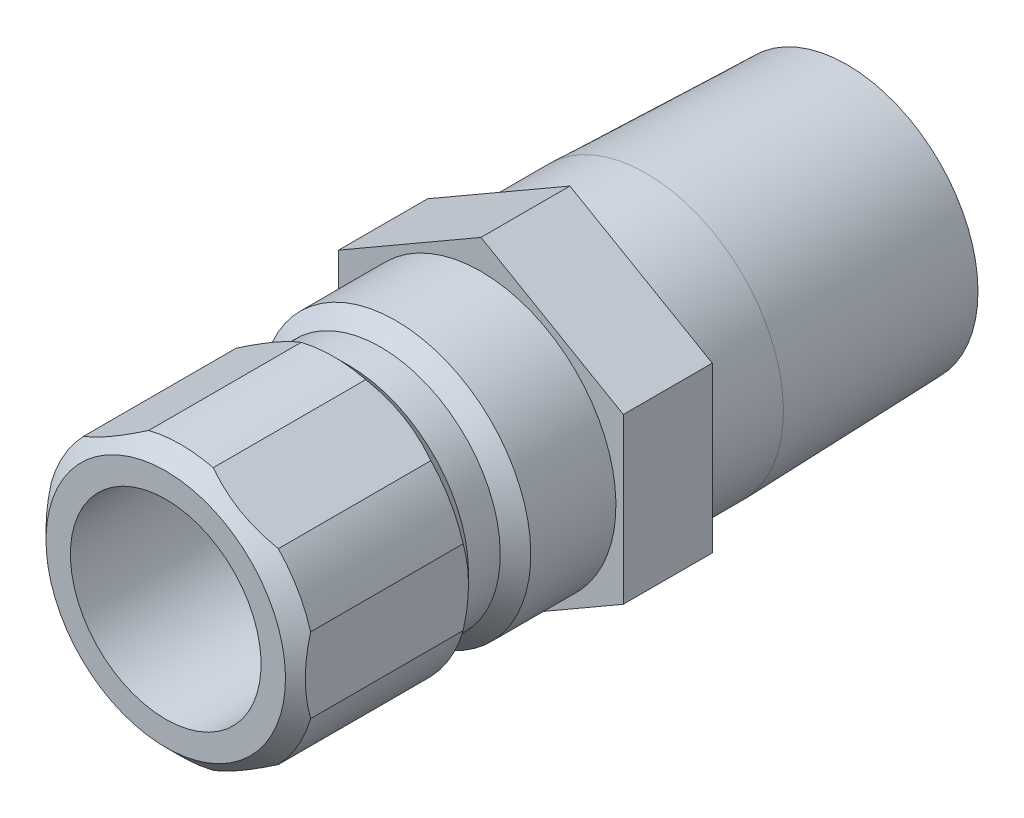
ISO-10303-21;
HEADER;
FILE_DESCRIPTION(('STEP AP214'),'2;1');
FILE_NAME('part.step','',(''),(''),'','','');
FILE_SCHEMA(('AUTOMOTIVE_DESIGN { 1 0 10303 214 1 1 1 1 }'));
ENDSEC;
DATA;
#1=APPLICATION_CONTEXT('core data for automotive mechanical design processes');
#2=APPLICATION_PROTOCOL_DEFINITION('international standard','automotive_design',2000,#1);
#3=PRODUCT_CONTEXT('',#1,'mechanical');
#4=PRODUCT('Part','Part','',(#3));
#5=PRODUCT_RELATED_PRODUCT_CATEGORY('part','',(#4));
#6=PRODUCT_DEFINITION_FORMATION('','',#4);
#7=PRODUCT_DEFINITION_CONTEXT('part definition',#1,'design');
#8=PRODUCT_DEFINITION('design','',#6,#7);
#9=PRODUCT_DEFINITION_SHAPE('','',#8);
#10=(LENGTH_UNIT() NAMED_UNIT(*) SI_UNIT(.MILLI.,.METRE.));
#11=(NAMED_UNIT(*) PLANE_ANGLE_UNIT() SI_UNIT($,.RADIAN.));
#12=(NAMED_UNIT(*) SI_UNIT($,.STERADIAN.) SOLID_ANGLE_UNIT());
#13=UNCERTAINTY_MEASURE_WITH_UNIT(LENGTH_MEASURE(1.E-05),#10,'distance_accuracy_value','');
#14=(GEOMETRIC_REPRESENTATION_CONTEXT(3) GLOBAL_UNCERTAINTY_ASSIGNED_CONTEXT((#13)) GLOBAL_UNIT_ASSIGNED_CONTEXT((#10,
#11,#12)) REPRESENTATION_CONTEXT('',''));
#15=CARTESIAN_POINT('',(0.,0.,0.));
#16=DIRECTION('',(0.,0.,1.));
#17=DIRECTION('',(1.,0.,0.));
#18=AXIS2_PLACEMENT_3D('',#15,#16,#17);
#19=CARTESIAN_POINT('',(0.,0.,0.));
#20=DIRECTION('',(0.,0.,-1.));
#21=DIRECTION('',(0.,1.,0.));
#22=AXIS2_PLACEMENT_3D('',#19,#20,#21);
#23=CYLINDRICAL_SURFACE('',#22,6.7437);
#24=DIRECTION('',(0.,0.,-1.));
#25=VECTOR('',#24,1.);
#26=CARTESIAN_POINT('',(-4.8646828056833,4.67036945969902,0.));
#27=LINE('',#26,#25);
#28=CARTESIAN_POINT('',(-4.86468280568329,4.67036945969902,7.36599999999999));
#29=VERTEX_POINT('',#28);
#30=CARTESIAN_POINT('',(-4.8646828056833,4.67036945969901,14.986));
#31=VERTEX_POINT('',#30);
#32=EDGE_CURVE('E526',#29,#31,#27,.F.);
#33=ORIENTED_EDGE('',*,*,#32,.F.);
#34=CARTESIAN_POINT('',(0.,0.,7.36599999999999));
#35=DIRECTION('',(0.,0.,-1.));
#36=DIRECTION('',(0.,1.,0.));
#37=AXIS2_PLACEMENT_3D('',#34,#35,#36);
#38=CIRCLE('',#37,6.7437);
#39=CARTESIAN_POINT('',(-6.477,1.87775416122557,7.36599999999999));
#40=VERTEX_POINT('',#39);
#41=EDGE_CURVE('E188',#40,#29,#38,.T.);
#42=ORIENTED_EDGE('',*,*,#41,.F.);
#43=DIRECTION('',(0.,0.,-1.));
#44=VECTOR('',#43,1.);
#45=CARTESIAN_POINT('',(-6.477,1.87775416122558,0.));
#46=LINE('',#45,#44);
#47=CARTESIAN_POINT('',(-6.477,1.87775416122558,14.986));
#48=VERTEX_POINT('',#47);
#49=EDGE_CURVE('E61',#48,#40,#46,.T.);
#50=ORIENTED_EDGE('',*,*,#49,.F.);
#51=CARTESIAN_POINT('',(0.,0.,14.986));
#52=DIRECTION('',(0.,0.,-1.));
#53=DIRECTION('',(0.,1.,0.));
#54=AXIS2_PLACEMENT_3D('',#51,#52,#53);
#55=CIRCLE('',#54,6.7437);
#56=EDGE_CURVE('E199',#48,#31,#55,.T.);
#57=ORIENTED_EDGE('',*,*,#56,.T.);
#58=EDGE_LOOP('',(#33,#42,#50,#57));
#59=FACE_BOUND('',#58,.T.);
#60=ADVANCED_FACE('F34',(#59),#23,.T.);
#61=DIRECTION('',(0.,0.,-1.));
#62=VECTOR('',#61,1.);
#63=CARTESIAN_POINT('',(-6.477,-1.87775416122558,0.));
#64=LINE('',#63,#62);
#65=CARTESIAN_POINT('',(-6.477,-1.87775416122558,7.36599999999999));
#66=VERTEX_POINT('',#65);
#67=CARTESIAN_POINT('',(-6.477,-1.87775416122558,14.986));
#68=VERTEX_POINT('',#67);
#69=EDGE_CURVE('E219',#66,#68,#64,.F.);
#70=ORIENTED_EDGE('',*,*,#69,.F.);
#71=CARTESIAN_POINT('',(-4.86468280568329,-4.67036945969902,7.36599999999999));
#72=VERTEX_POINT('',#71);
#73=EDGE_CURVE('E192',#72,#66,#38,.T.);
#74=ORIENTED_EDGE('',*,*,#73,.F.);
#75=DIRECTION('',(0.,0.,-1.));
#76=VECTOR('',#75,1.);
#77=CARTESIAN_POINT('',(-4.86468280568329,-4.67036945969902,0.));
#78=LINE('',#77,#76);
#79=CARTESIAN_POINT('',(-4.86468280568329,-4.67036945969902,14.986));
#80=VERTEX_POINT('',#79);
#81=EDGE_CURVE('E217',#80,#72,#78,.T.);
#82=ORIENTED_EDGE('',*,*,#81,.F.);
#83=EDGE_CURVE('E220',#80,#68,#55,.T.);
#84=ORIENTED_EDGE('',*,*,#83,.T.);
#85=EDGE_LOOP('',(#70,#74,#82,#84));
#86=FACE_BOUND('',#85,.T.);
#87=ADVANCED_FACE('F215',(#86),#23,.T.);
#88=DIRECTION('',(0.,0.,-1.));
#89=VECTOR('',#88,1.);
#90=CARTESIAN_POINT('',(-1.61231719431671,-6.5481236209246,0.));
#91=LINE('',#90,#89);
#92=CARTESIAN_POINT('',(-1.61231719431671,-6.5481236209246,7.36599999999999));
#93=VERTEX_POINT('',#92);
#94=CARTESIAN_POINT('',(-1.61231719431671,-6.5481236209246,14.986));
#95=VERTEX_POINT('',#94);
#96=EDGE_CURVE('E298',#93,#95,#91,.F.);
#97=ORIENTED_EDGE('',*,*,#96,.F.);
#98=CARTESIAN_POINT('',(1.61231719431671,-6.5481236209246,7.36599999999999));
#99=VERTEX_POINT('',#98);
#100=EDGE_CURVE('E202',#99,#93,#38,.T.);
#101=ORIENTED_EDGE('',*,*,#100,.F.);
#102=DIRECTION('',(0.,0.,-1.));
#103=VECTOR('',#102,1.);
#104=CARTESIAN_POINT('',(1.6123171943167,-6.5481236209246,0.));
#105=LINE('',#104,#103);
#106=CARTESIAN_POINT('',(1.6123171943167,-6.5481236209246,14.986));
#107=VERTEX_POINT('',#106);
#108=EDGE_CURVE('E315',#107,#99,#105,.T.);
#109=ORIENTED_EDGE('',*,*,#108,.F.);
#110=EDGE_CURVE('E311',#107,#95,#55,.T.);
#111=ORIENTED_EDGE('',*,*,#110,.T.);
#112=EDGE_LOOP('',(#97,#101,#109,#111));
#113=FACE_BOUND('',#112,.T.);
#114=ADVANCED_FACE('F314',(#113),#23,.T.);
#115=DIRECTION('',(0.,0.,-1.));
#116=VECTOR('',#115,1.);
#117=CARTESIAN_POINT('',(4.8646828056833,-4.67036945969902,0.));
#118=LINE('',#117,#116);
#119=CARTESIAN_POINT('',(4.8646828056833,-4.67036945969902,7.36599999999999));
#120=VERTEX_POINT('',#119);
#121=CARTESIAN_POINT('',(4.8646828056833,-4.67036945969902,14.986));
#122=VERTEX_POINT('',#121);
#123=EDGE_CURVE('E295',#120,#122,#118,.F.);
#124=ORIENTED_EDGE('',*,*,#123,.F.);
#125=CARTESIAN_POINT('',(6.477,-1.87775416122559,7.36599999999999));
#126=VERTEX_POINT('',#125);
#127=EDGE_CURVE('E197',#126,#120,#38,.T.);
#128=ORIENTED_EDGE('',*,*,#127,.F.);
#129=DIRECTION('',(0.,0.,-1.));
#130=VECTOR('',#129,1.);
#131=CARTESIAN_POINT('',(6.477,-1.87775416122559,0.));
#132=LINE('',#131,#130);
#133=CARTESIAN_POINT('',(6.477,-1.87775416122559,14.986));
#134=VERTEX_POINT('',#133);
#135=EDGE_CURVE('E362',#134,#126,#132,.T.);
#136=ORIENTED_EDGE('',*,*,#135,.F.);
#137=EDGE_CURVE('E316',#134,#122,#55,.T.);
#138=ORIENTED_EDGE('',*,*,#137,.T.);
#139=EDGE_LOOP('',(#124,#128,#136,#138));
#140=FACE_BOUND('',#139,.T.);
#141=ADVANCED_FACE('F349',(#140),#23,.T.);
#142=DIRECTION('',(0.,0.,-1.));
#143=VECTOR('',#142,1.);
#144=CARTESIAN_POINT('',(6.477,1.87775416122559,0.));
#145=LINE('',#144,#143);
#146=CARTESIAN_POINT('',(6.477,1.87775416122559,7.36599999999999));
#147=VERTEX_POINT('',#146);
#148=CARTESIAN_POINT('',(6.477,1.87775416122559,14.986));
#149=VERTEX_POINT('',#148);
#150=EDGE_CURVE('E357',#147,#149,#145,.F.);
#151=ORIENTED_EDGE('',*,*,#150,.F.);
#152=CARTESIAN_POINT('',(4.86468280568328,4.67036945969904,7.36599999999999));
#153=VERTEX_POINT('',#152);
#154=EDGE_CURVE('E191',#153,#147,#38,.T.);
#155=ORIENTED_EDGE('',*,*,#154,.F.);
#156=DIRECTION('',(0.,0.,-1.));
#157=VECTOR('',#156,1.);
#158=CARTESIAN_POINT('',(4.86468280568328,4.67036945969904,0.));
#159=LINE('',#158,#157);
#160=CARTESIAN_POINT('',(4.86468280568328,4.67036945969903,14.986));
#161=VERTEX_POINT('',#160);
#162=EDGE_CURVE('E168',#161,#153,#159,.T.);
#163=ORIENTED_EDGE('',*,*,#162,.F.);
#164=EDGE_CURVE('E200',#161,#149,#55,.T.);
#165=ORIENTED_EDGE('',*,*,#164,.T.);
#166=EDGE_LOOP('',(#151,#155,#163,#165));
#167=FACE_BOUND('',#166,.T.);
#168=ADVANCED_FACE('F334',(#167),#23,.T.);
#169=CARTESIAN_POINT('',(0.,0.,0.));
#170=DIRECTION('',(0.,0.,-1.));
#171=DIRECTION('',(0.,1.,0.));
#172=AXIS2_PLACEMENT_3D('',#169,#170,#171);
#173=CYLINDRICAL_SURFACE('',#172,6.858);
#174=CARTESIAN_POINT('',(0.,0.,-8.25500000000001));
#175=DIRECTION('',(0.,0.,-1.));
#176=DIRECTION('',(0.,1.,0.));
#177=AXIS2_PLACEMENT_3D('',#174,#175,#176);
#178=CIRCLE('',#177,6.858);
#179=CARTESIAN_POINT('',(0.,6.858,-8.25500000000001));
#180=VERTEX_POINT('',#179);
#181=EDGE_CURVE('E455',#180,#180,#178,.T.);
#182=ORIENTED_EDGE('',*,*,#181,.F.);
#183=EDGE_LOOP('',(#182));
#184=FACE_BOUND('',#183,.T.);
#185=CARTESIAN_POINT('',(0.,0.,-4.445));
#186=DIRECTION('',(0.,0.,1.));
#187=DIRECTION('',(1.,0.,0.));
#188=AXIS2_PLACEMENT_3D('',#185,#186,#187);
#189=CIRCLE('',#188,6.858);
#190=CARTESIAN_POINT('',(6.858,0.,-4.445));
#191=VERTEX_POINT('',#190);
#192=EDGE_CURVE('E471',#191,#191,#189,.F.);
#193=ORIENTED_EDGE('',*,*,#192,.T.);
#194=EDGE_LOOP('',(#193));
#195=FACE_BOUND('',#194,.T.);
#196=ADVANCED_FACE('F328',(#184,#195),#173,.T.);
#197=CARTESIAN_POINT('',(0.,0.,0.));
#198=DIRECTION('',(0.,0.,-1.));
#199=DIRECTION('',(0.,1.,0.));
#200=AXIS2_PLACEMENT_3D('',#197,#198,#199);
#201=CYLINDRICAL_SURFACE('',#200,4.7625);
#202=CARTESIAN_POINT('',(0.,0.,3.556));
#203=DIRECTION('',(0.,0.,-1.));
#204=DIRECTION('',(0.,1.,0.));
#205=AXIS2_PLACEMENT_3D('',#202,#203,#204);
#206=CIRCLE('',#205,4.7625);
#207=CARTESIAN_POINT('',(0.,4.7625,3.556));
#208=VERTEX_POINT('',#207);
#209=EDGE_CURVE('E469',#208,#208,#206,.T.);
#210=ORIENTED_EDGE('',*,*,#209,.T.);
#211=EDGE_LOOP('',(#210));
#212=FACE_BOUND('',#211,.T.);
#213=CARTESIAN_POINT('',(0.,0.,15.748));
#214=DIRECTION('',(0.,0.,-1.));
#215=DIRECTION('',(0.,1.,0.));
#216=AXIS2_PLACEMENT_3D('',#213,#214,#215);
#217=CIRCLE('',#216,4.7625);
#218=CARTESIAN_POINT('',(0.,4.7625,15.748));
#219=VERTEX_POINT('',#218);
#220=EDGE_CURVE('E174',#219,#219,#217,.T.);
#221=ORIENTED_EDGE('',*,*,#220,.F.);
#222=EDGE_LOOP('',(#221));
#223=FACE_BOUND('',#222,.T.);
#224=ADVANCED_FACE('F36',(#212,#223),#201,.F.);
#225=CARTESIAN_POINT('',(0.,4.7625,15.748));
#226=DIRECTION('',(0.,0.,1.));
#227=DIRECTION('',(0.,-1.,0.));
#228=AXIS2_PLACEMENT_3D('',#225,#226,#227);
#229=PLANE('',#228);
#230=ORIENTED_EDGE('',*,*,#220,.T.);
#231=EDGE_LOOP('',(#230));
#232=FACE_BOUND('',#231,.T.);
#233=CARTESIAN_POINT('',(0.,0.,15.748));
#234=DIRECTION('',(0.,0.,-1.));
#235=DIRECTION('',(0.,1.,0.));
#236=AXIS2_PLACEMENT_3D('',#233,#234,#235);
#237=CIRCLE('',#236,5.9817);
#238=CARTESIAN_POINT('',(0.,5.9817,15.748));
#239=VERTEX_POINT('',#238);
#240=EDGE_CURVE('E319',#239,#239,#237,.T.);
#241=ORIENTED_EDGE('',*,*,#240,.F.);
#242=EDGE_LOOP('',(#241));
#243=FACE_BOUND('',#242,.T.);
#244=ADVANCED_FACE('F324',(#232,#243),#229,.T.);
#245=CARTESIAN_POINT('',(0.,0.,14.986));
#246=DIRECTION('',(0.,0.,-1.));
#247=DIRECTION('',(0.,1.,0.));
#248=AXIS2_PLACEMENT_3D('',#245,#246,#247);
#249=CONICAL_SURFACE('',#248,6.7437,0.785398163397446);
#250=CARTESIAN_POINT('',(-4.86530473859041,4.67001038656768,14.9858));
#251=CARTESIAN_POINT('',(-4.72486305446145,4.75109443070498,15.0310202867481));
#252=CARTESIAN_POINT('',(-4.58312979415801,4.83292416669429,15.0711660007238));
#253=CARTESIAN_POINT('',(-4.29751110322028,4.99782619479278,15.1402365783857));
#254=CARTESIAN_POINT('',(-4.1536239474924,5.0808994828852,15.1691518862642));
#255=CARTESIAN_POINT('',(-3.8673393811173,5.2461859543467,15.2141425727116));
#256=CARTESIAN_POINT('',(-3.7249720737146,5.32838175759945,15.2304694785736));
#257=CARTESIAN_POINT('',(-3.43963286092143,5.49312242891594,15.2506210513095));
#258=CARTESIAN_POINT('',(-3.29666126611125,5.57566711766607,15.2544515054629));
#259=CARTESIAN_POINT('',(-3.02472390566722,5.73267022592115,15.2497120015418));
#260=CARTESIAN_POINT('',(-2.89574173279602,5.807138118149,15.2423062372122));
#261=CARTESIAN_POINT('',(-2.63846984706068,5.95567411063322,15.2174303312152));
#262=CARTESIAN_POINT('',(-2.51018036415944,6.02974207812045,15.1999570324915));
#263=CARTESIAN_POINT('',(-2.25244237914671,6.17854717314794,15.1550584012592));
#264=CARTESIAN_POINT('',(-2.1230180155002,6.25327036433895,15.1274506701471));
#265=CARTESIAN_POINT('',(-1.86594955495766,6.40168890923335,15.0631944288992));
#266=CARTESIAN_POINT('',(-1.73830430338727,6.47538492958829,15.026552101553));
#267=CARTESIAN_POINT('',(-1.61169526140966,6.5484826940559,14.9858));
#268=B_SPLINE_CURVE_WITH_KNOTS('',3,(#250,#251,#252,#253,#254,#255,#256,#257,#258,#259,#260,
#261,#262,#263,#264,#265,#266,#267),.UNSPECIFIED.,.F.,.F.,(4,2,2,2,2,2,2,2,4),(0.,
0.505093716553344,1.01061627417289,1.50575564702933,2.00066568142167,2.4476800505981,
2.89483467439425,3.35046683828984,3.80578805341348),.UNSPECIFIED.);
#269=CARTESIAN_POINT('',(-1.6123171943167,6.5481236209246,14.986));
#270=VERTEX_POINT('',#269);
#271=EDGE_CURVE('E506',#31,#270,#268,.T.);
#272=ORIENTED_EDGE('',*,*,#271,.F.);
#273=ORIENTED_EDGE('',*,*,#56,.F.);
#274=CARTESIAN_POINT('',(-6.477,-7.31595245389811,11.9585849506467));
#275=CARTESIAN_POINT('',(-6.477,-7.1371619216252,12.09242068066));
#276=CARTESIAN_POINT('',(-6.477,-6.95735466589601,12.2249205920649));
#277=CARTESIAN_POINT('',(-6.477,-6.59531185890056,12.4866559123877));
#278=CARTESIAN_POINT('',(-6.477,-6.41307569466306,12.6158904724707));
#279=CARTESIAN_POINT('',(-6.477,-6.04444818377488,12.8714195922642));
#280=CARTESIAN_POINT('',(-6.477,-5.85803557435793,12.9976835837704));
#281=CARTESIAN_POINT('',(-6.477,-5.48202253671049,13.245356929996));
#282=CARTESIAN_POINT('',(-6.477,-5.29242233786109,13.3667666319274));
#283=CARTESIAN_POINT('',(-6.477,-4.8990824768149,13.6101330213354));
#284=CARTESIAN_POINT('',(-6.477,-4.69513615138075,13.7317573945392));
#285=CARTESIAN_POINT('',(-6.477,-4.2824994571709,13.9668032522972));
#286=CARTESIAN_POINT('',(-6.477,-4.07380836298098,14.0802234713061));
#287=CARTESIAN_POINT('',(-6.477,-3.65173370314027,14.2964010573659));
#288=CARTESIAN_POINT('',(-6.477,-3.43836632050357,14.3991897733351));
#289=CARTESIAN_POINT('',(-6.477,-3.00590599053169,14.59180459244));
#290=CARTESIAN_POINT('',(-6.477,-2.78681563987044,14.6816364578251));
#291=CARTESIAN_POINT('',(-6.477,-2.35869152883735,14.8392509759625));
#292=CARTESIAN_POINT('',(-6.477,-2.15007621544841,14.9081583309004));
#293=CARTESIAN_POINT('',(-6.477,-1.72794730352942,15.029215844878));
#294=CARTESIAN_POINT('',(-6.477,-1.51443335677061,15.0813648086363));
#295=CARTESIAN_POINT('',(-6.477,-1.08726616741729,15.1653541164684));
#296=CARTESIAN_POINT('',(-6.477,-0.873680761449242,15.1975339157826));
#297=CARTESIAN_POINT('',(-6.477,-0.444382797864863,15.2409825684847));
#298=CARTESIAN_POINT('',(-6.477,-0.228670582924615,15.2522547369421));
#299=CARTESIAN_POINT('',(-6.477,0.195590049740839,15.2531049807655));
#300=CARTESIAN_POINT('',(-6.477,0.40413733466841,15.2433943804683));
#301=CARTESIAN_POINT('',(-6.477,0.819375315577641,15.2043531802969));
#302=CARTESIAN_POINT('',(-6.477,1.026065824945,15.1750206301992));
#303=CARTESIAN_POINT('',(-6.477,1.43958683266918,15.0978125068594));
#304=CARTESIAN_POINT('',(-6.477,1.64635839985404,15.0496261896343));
#305=CARTESIAN_POINT('',(-6.477,2.05541277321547,14.9372378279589));
#306=CARTESIAN_POINT('',(-6.477,2.25769600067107,14.8730372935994));
#307=CARTESIAN_POINT('',(-6.477,2.67942290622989,14.7234325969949));
#308=CARTESIAN_POINT('',(-6.477,2.89830973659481,14.6364736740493));
#309=CARTESIAN_POINT('',(-6.477,3.33036785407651,14.4492510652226));
#310=CARTESIAN_POINT('',(-6.477,3.5435363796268,14.3489810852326));
#311=CARTESIAN_POINT('',(-6.477,3.96521765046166,14.1375266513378));
#312=CARTESIAN_POINT('',(-6.477,4.17371291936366,14.026307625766));
#313=CARTESIAN_POINT('',(-6.477,4.58589470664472,13.7954185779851));
#314=CARTESIAN_POINT('',(-6.477,4.78958199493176,13.6757499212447));
#315=CARTESIAN_POINT('',(-6.477,5.18271200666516,13.4357848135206));
#316=CARTESIAN_POINT('',(-6.477,5.37235766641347,13.3158190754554));
#317=CARTESIAN_POINT('',(-6.477,5.74839484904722,13.0708760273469));
#318=CARTESIAN_POINT('',(-6.477,5.93478612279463,12.9458983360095));
#319=CARTESIAN_POINT('',(-6.477,6.30322303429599,12.6928680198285));
#320=CARTESIAN_POINT('',(-6.477,6.48529173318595,12.5648488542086));
#321=CARTESIAN_POINT('',(-6.477,6.84694630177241,12.3054498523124));
#322=CARTESIAN_POINT('',(-6.477,7.02653283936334,12.174070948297));
#323=CARTESIAN_POINT('',(-6.477,7.20508094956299,12.041319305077));
#324=B_SPLINE_CURVE_WITH_KNOTS('',3,(#274,#275,#276,#277,#278,#279,#280,#281,#282,#283,#284,
#285,#286,#287,#288,#289,#290,#291,#292,#293,#294,#295,#296,#297,#298,#299,#300,#301,#302,#303,
#304,#305,#306,#307,#308,#309,#310,#311,#312,#313,#314,#315,#316,#317,#318,#319,#320,#321,#322,
#323),.UNSPECIFIED.,.F.,.F.,(4,2,2,2,2,2,2,2,2,2,2,2,2,2,2,2,2,2,2,2,2,2,2,2,4),(0.,
0.670015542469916,1.34020350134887,2.01558827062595,2.69092464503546,3.40314702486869,
4.11547903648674,4.82564684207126,5.53549783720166,6.19401709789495,6.85258331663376,
7.49962373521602,8.14656155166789,8.77191276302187,9.39732613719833,10.0335138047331,
10.6696415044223,11.3756703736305,12.0820342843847,12.7907048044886,13.4992610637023,
14.1723809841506,14.845552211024,15.5132243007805,16.1807130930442),.UNSPECIFIED.);
#325=EDGE_CURVE('E222',#68,#48,#324,.T.);
#326=ORIENTED_EDGE('',*,*,#325,.F.);
#327=ORIENTED_EDGE('',*,*,#83,.F.);
#328=CARTESIAN_POINT('',(-1.61169526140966,-6.5484826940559,14.9858));
#329=CARTESIAN_POINT('',(-1.75213694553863,-6.4673986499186,15.0310202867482));
#330=CARTESIAN_POINT('',(-1.89387020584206,-6.38556891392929,15.0711660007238));
#331=CARTESIAN_POINT('',(-2.1794888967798,-6.2206668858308,15.1402365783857));
#332=CARTESIAN_POINT('',(-2.32337605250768,-6.13759359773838,15.1691518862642));
#333=CARTESIAN_POINT('',(-2.60966061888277,-5.97230712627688,15.2141425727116));
#334=CARTESIAN_POINT('',(-2.75202792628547,-5.89011132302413,15.2304694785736));
#335=CARTESIAN_POINT('',(-3.03736713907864,-5.72537065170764,15.2506210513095));
#336=CARTESIAN_POINT('',(-3.18033873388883,-5.64282596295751,15.2544515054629));
#337=CARTESIAN_POINT('',(-3.45227609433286,-5.48582285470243,15.2497120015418));
#338=CARTESIAN_POINT('',(-3.58125826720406,-5.41135496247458,15.2423062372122));
#339=CARTESIAN_POINT('',(-3.83853015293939,-5.26281896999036,15.2174303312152));
#340=CARTESIAN_POINT('',(-3.96681963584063,-5.18875100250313,15.1999570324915));
#341=CARTESIAN_POINT('',(-4.22455762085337,-5.03994590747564,15.1550584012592));
#342=CARTESIAN_POINT('',(-4.35398198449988,-4.96522271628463,15.1274506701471));
#343=CARTESIAN_POINT('',(-4.61105044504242,-4.81680417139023,15.0631944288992));
#344=CARTESIAN_POINT('',(-4.7386956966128,-4.74310815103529,15.026552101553));
#345=CARTESIAN_POINT('',(-4.86530473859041,-4.67001038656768,14.9858));
#346=B_SPLINE_CURVE_WITH_KNOTS('',3,(#328,#329,#330,#331,#332,#333,#334,#335,#336,#337,#338,
#339,#340,#341,#342,#343,#344,#345),.UNSPECIFIED.,.F.,.F.,(4,2,2,2,2,2,2,2,4),(0.,
0.505093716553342,1.01061627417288,1.50575564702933,2.00066568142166,2.44768005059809,
2.89483467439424,3.35046683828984,3.80578805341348),.UNSPECIFIED.);
#347=EDGE_CURVE('E225',#95,#80,#346,.T.);
#348=ORIENTED_EDGE('',*,*,#347,.F.);
#349=ORIENTED_EDGE('',*,*,#110,.F.);
#350=CARTESIAN_POINT('',(4.86530473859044,-4.67001038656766,14.9858));
#351=CARTESIAN_POINT('',(4.72486305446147,-4.75109443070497,15.0310202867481));
#352=CARTESIAN_POINT('',(4.58312979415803,-4.83292416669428,15.0711660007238));
#353=CARTESIAN_POINT('',(4.2975111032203,-4.99782619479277,15.1402365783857));
#354=CARTESIAN_POINT('',(4.15362394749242,-5.08089948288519,15.1691518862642));
#355=CARTESIAN_POINT('',(3.86733938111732,-5.24618595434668,15.2141425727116));
#356=CARTESIAN_POINT('',(3.72497207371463,-5.32838175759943,15.2304694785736));
#357=CARTESIAN_POINT('',(3.43963286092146,-5.49312242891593,15.2506210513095));
#358=CARTESIAN_POINT('',(3.29666126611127,-5.57566711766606,15.2544515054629));
#359=CARTESIAN_POINT('',(3.0247239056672,-5.73267022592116,15.2497120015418));
#360=CARTESIAN_POINT('',(2.89574173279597,-5.80713811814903,15.2423062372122));
#361=CARTESIAN_POINT('',(2.63846984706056,-5.95567411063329,15.2174303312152));
#362=CARTESIAN_POINT('',(2.51018036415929,-6.02974207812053,15.1999570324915));
#363=CARTESIAN_POINT('',(2.25244237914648,-6.17854717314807,15.1550584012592));
#364=CARTESIAN_POINT('',(2.12301801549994,-6.2532703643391,15.127450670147));
#365=CARTESIAN_POINT('',(1.86594955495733,-6.40168890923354,15.0631944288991));
#366=CARTESIAN_POINT('',(1.7383043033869,-6.4753849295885,15.0265521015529));
#367=CARTESIAN_POINT('',(1.61169526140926,-6.54848269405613,14.9857999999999));
#368=B_SPLINE_CURVE_WITH_KNOTS('',3,(#350,#351,#352,#353,#354,#355,#356,#357,#358,#359,#360,
#361,#362,#363,#364,#365,#366,#367),.UNSPECIFIED.,.F.,.F.,(4,2,2,2,2,2,2,2,4),(0.,
0.505093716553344,1.01061627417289,1.50575564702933,2.00066568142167,2.44768005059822,
2.89483467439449,3.35046683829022,3.80578805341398),.UNSPECIFIED.);
#369=EDGE_CURVE('E289',#122,#107,#368,.T.);
#370=ORIENTED_EDGE('',*,*,#369,.F.);
#371=ORIENTED_EDGE('',*,*,#137,.F.);
#372=CARTESIAN_POINT('',(6.477,-7.31595245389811,11.9585849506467));
#373=CARTESIAN_POINT('',(6.477,-7.1371619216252,12.09242068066));
#374=CARTESIAN_POINT('',(6.477,-6.957354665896,12.2249205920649));
#375=CARTESIAN_POINT('',(6.477,-6.59531185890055,12.4866559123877));
#376=CARTESIAN_POINT('',(6.477,-6.41307569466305,12.6158904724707));
#377=CARTESIAN_POINT('',(6.477,-6.04444818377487,12.8714195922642));
#378=CARTESIAN_POINT('',(6.477,-5.85803557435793,12.9976835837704));
#379=CARTESIAN_POINT('',(6.477,-5.48202253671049,13.245356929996));
#380=CARTESIAN_POINT('',(6.477,-5.29242233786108,13.3667666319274));
#381=CARTESIAN_POINT('',(6.477,-4.8990824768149,13.6101330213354));
#382=CARTESIAN_POINT('',(6.477,-4.69513615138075,13.7317573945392));
#383=CARTESIAN_POINT('',(6.477,-4.28249945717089,13.9668032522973));
#384=CARTESIAN_POINT('',(6.477,-4.07380836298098,14.0802234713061));
#385=CARTESIAN_POINT('',(6.477,-3.65173370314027,14.2964010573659));
#386=CARTESIAN_POINT('',(6.477,-3.43836632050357,14.3991897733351));
#387=CARTESIAN_POINT('',(6.477,-3.00590599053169,14.59180459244));
#388=CARTESIAN_POINT('',(6.477,-2.78681563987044,14.6816364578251));
#389=CARTESIAN_POINT('',(6.477,-2.35869152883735,14.8392509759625));
#390=CARTESIAN_POINT('',(6.477,-2.15007621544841,14.9081583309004));
#391=CARTESIAN_POINT('',(6.477,-1.72794730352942,15.029215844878));
#392=CARTESIAN_POINT('',(6.477,-1.51443335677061,15.0813648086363));
#393=CARTESIAN_POINT('',(6.477,-1.08726616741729,15.1653541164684));
#394=CARTESIAN_POINT('',(6.477,-0.873680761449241,15.1975339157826));
#395=CARTESIAN_POINT('',(6.477,-0.444382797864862,15.2409825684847));
#396=CARTESIAN_POINT('',(6.477,-0.228670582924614,15.2522547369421));
#397=CARTESIAN_POINT('',(6.477,0.19559004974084,15.2531049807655));
#398=CARTESIAN_POINT('',(6.477,0.404137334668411,15.2433943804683));
#399=CARTESIAN_POINT('',(6.477,0.819375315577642,15.2043531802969));
#400=CARTESIAN_POINT('',(6.477,1.026065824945,15.1750206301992));
#401=CARTESIAN_POINT('',(6.477,1.43958683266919,15.0978125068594));
#402=CARTESIAN_POINT('',(6.477,1.64635839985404,15.0496261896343));
#403=CARTESIAN_POINT('',(6.477,2.05541277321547,14.937237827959));
#404=CARTESIAN_POINT('',(6.477,2.25769600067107,14.8730372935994));
#405=CARTESIAN_POINT('',(6.477,2.67942290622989,14.7234325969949));
#406=CARTESIAN_POINT('',(6.477,2.89830973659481,14.6364736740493));
#407=CARTESIAN_POINT('',(6.477,3.33036785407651,14.4492510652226));
#408=CARTESIAN_POINT('',(6.477,3.5435363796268,14.3489810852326));
#409=CARTESIAN_POINT('',(6.477,3.96521765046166,14.1375266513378));
#410=CARTESIAN_POINT('',(6.477,4.17371291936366,14.026307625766));
#411=CARTESIAN_POINT('',(6.477,4.58589470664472,13.7954185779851));
#412=CARTESIAN_POINT('',(6.477,4.78958199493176,13.6757499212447));
#413=CARTESIAN_POINT('',(6.477,5.18271200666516,13.4357848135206));
#414=CARTESIAN_POINT('',(6.477,5.37235766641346,13.3158190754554));
#415=CARTESIAN_POINT('',(6.477,5.74839484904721,13.0708760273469));
#416=CARTESIAN_POINT('',(6.477,5.93478612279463,12.9458983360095));
#417=CARTESIAN_POINT('',(6.477,6.30322303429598,12.6928680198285));
#418=CARTESIAN_POINT('',(6.477,6.48529173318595,12.5648488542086));
#419=CARTESIAN_POINT('',(6.477,6.84694630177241,12.3054498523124));
#420=CARTESIAN_POINT('',(6.477,7.02653283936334,12.174070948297));
#421=CARTESIAN_POINT('',(6.477,7.20508094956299,12.041319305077));
#422=B_SPLINE_CURVE_WITH_KNOTS('',3,(#372,#373,#374,#375,#376,#377,#378,#379,#380,#381,#382,
#383,#384,#385,#386,#387,#388,#389,#390,#391,#392,#393,#394,#395,#396,#397,#398,#399,#400,#401,
#402,#403,#404,#405,#406,#407,#408,#409,#410,#411,#412,#413,#414,#415,#416,#417,#418,#419,#420,
#421),.UNSPECIFIED.,.F.,.F.,(4,2,2,2,2,2,2,2,2,2,2,2,2,2,2,2,2,2,2,2,2,2,2,2,4),(0.,
0.670015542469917,1.34020350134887,2.01558827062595,2.69092464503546,3.40314702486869,
4.11547903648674,4.82564684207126,5.53549783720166,6.19401709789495,6.85258331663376,
7.49962373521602,8.14656155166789,8.77191276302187,9.39732613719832,10.0335138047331,
10.6696415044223,11.3756703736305,12.0820342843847,12.7907048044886,13.4992610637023,
14.1723809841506,14.845552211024,15.5132243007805,16.1807130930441),.UNSPECIFIED.);
#423=EDGE_CURVE('E361',#149,#134,#422,.F.);
#424=ORIENTED_EDGE('',*,*,#423,.F.);
#425=ORIENTED_EDGE('',*,*,#164,.F.);
#426=CARTESIAN_POINT('',(1.61169526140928,6.54848269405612,14.9857999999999));
#427=CARTESIAN_POINT('',(1.75213694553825,6.46739864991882,15.031020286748));
#428=CARTESIAN_POINT('',(1.89387020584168,6.38556891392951,15.0711660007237));
#429=CARTESIAN_POINT('',(2.17948889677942,6.22066688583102,15.1402365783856));
#430=CARTESIAN_POINT('',(2.3233760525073,6.1375935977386,15.1691518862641));
#431=CARTESIAN_POINT('',(2.6096606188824,5.9723071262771,15.2141425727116));
#432=CARTESIAN_POINT('',(2.7520279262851,5.89011132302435,15.2304694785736));
#433=CARTESIAN_POINT('',(3.03736713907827,5.72537065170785,15.2506210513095));
#434=CARTESIAN_POINT('',(3.18033873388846,5.64282596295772,15.2544515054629));
#435=CARTESIAN_POINT('',(3.45227609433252,5.48582285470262,15.2497120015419));
#436=CARTESIAN_POINT('',(3.58125826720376,5.41135496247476,15.2423062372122));
#437=CARTESIAN_POINT('',(3.83853015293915,5.2628189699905,15.2174303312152));
#438=CARTESIAN_POINT('',(3.96681963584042,5.18875100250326,15.1999570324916));
#439=CARTESIAN_POINT('',(4.22455762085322,5.03994590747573,15.1550584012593));
#440=CARTESIAN_POINT('',(4.35398198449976,4.9652227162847,15.1274506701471));
#441=CARTESIAN_POINT('',(4.61105044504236,4.81680417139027,15.0631944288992));
#442=CARTESIAN_POINT('',(4.73869569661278,4.74310815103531,15.026552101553));
#443=CARTESIAN_POINT('',(4.86530473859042,4.67001038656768,14.9858));
#444=B_SPLINE_CURVE_WITH_KNOTS('',3,(#426,#427,#428,#429,#430,#431,#432,#433,#434,#435,#436,
#437,#438,#439,#440,#441,#442,#443),.UNSPECIFIED.,.F.,.F.,(4,2,2,2,2,2,2,2,4),(0.,
0.505093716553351,1.0106162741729,1.50575564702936,2.0006656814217,2.44768005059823,
2.89483467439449,3.35046683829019,3.80578805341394),.UNSPECIFIED.);
#445=CARTESIAN_POINT('',(1.61231719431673,6.54812362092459,14.986));
#446=VERTEX_POINT('',#445);
#447=EDGE_CURVE('E183',#446,#161,#444,.T.);
#448=ORIENTED_EDGE('',*,*,#447,.F.);
#449=EDGE_CURVE('E182',#270,#446,#55,.T.);
#450=ORIENTED_EDGE('',*,*,#449,.F.);
#451=EDGE_LOOP('',(#272,#273,#326,#327,#348,#349,#370,#371,#424,#425,#448,#450));
#452=FACE_BOUND('',#451,.T.);
#453=ORIENTED_EDGE('',*,*,#240,.T.);
#454=EDGE_LOOP('',(#453));
#455=FACE_BOUND('',#454,.T.);
#456=ADVANCED_FACE('F235',(#452,#455),#249,.T.);
#457=DIRECTION('',(0.,0.,-1.));
#458=VECTOR('',#457,1.);
#459=CARTESIAN_POINT('',(-1.6123171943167,6.5481236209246,0.));
#460=LINE('',#459,#458);
#461=CARTESIAN_POINT('',(-1.61231719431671,6.5481236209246,7.36599999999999));
#462=VERTEX_POINT('',#461);
#463=EDGE_CURVE('E53',#270,#462,#460,.T.);
#464=ORIENTED_EDGE('',*,*,#463,.F.);
#465=ORIENTED_EDGE('',*,*,#449,.T.);
#466=DIRECTION('',(0.,0.,-1.));
#467=VECTOR('',#466,1.);
#468=CARTESIAN_POINT('',(1.61231719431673,6.54812362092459,0.));
#469=LINE('',#468,#467);
#470=CARTESIAN_POINT('',(1.61231719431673,6.54812362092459,7.36599999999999));
#471=VERTEX_POINT('',#470);
#472=EDGE_CURVE('E165',#471,#446,#469,.F.);
#473=ORIENTED_EDGE('',*,*,#472,.F.);
#474=EDGE_CURVE('E180',#462,#471,#38,.T.);
#475=ORIENTED_EDGE('',*,*,#474,.F.);
#476=EDGE_LOOP('',(#464,#465,#473,#475));
#477=FACE_BOUND('',#476,.T.);
#478=ADVANCED_FACE('F179',(#477),#23,.T.);
#479=CARTESIAN_POINT('',(0.,0.,6.604));
#480=DIRECTION('',(0.,0.,1.));
#481=DIRECTION('',(0.,-1.,0.));
#482=AXIS2_PLACEMENT_3D('',#479,#480,#481);
#483=CONICAL_SURFACE('',#482,5.9817,0.785398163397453);
#484=CARTESIAN_POINT('',(-1.61169526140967,6.5484826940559,7.36619999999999));
#485=CARTESIAN_POINT('',(-1.75213694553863,6.46739864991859,7.32097971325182));
#486=CARTESIAN_POINT('',(-1.89387020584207,6.38556891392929,7.2808339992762));
#487=CARTESIAN_POINT('',(-2.1794888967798,6.2206668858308,7.21176342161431));
#488=CARTESIAN_POINT('',(-2.32337605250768,6.13759359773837,7.18284811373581));
#489=CARTESIAN_POINT('',(-2.60966061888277,5.97230712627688,7.13785742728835));
#490=CARTESIAN_POINT('',(-2.75202792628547,5.89011132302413,7.12153052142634));
#491=CARTESIAN_POINT('',(-3.03736713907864,5.72537065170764,7.10137894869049));
#492=CARTESIAN_POINT('',(-3.18033873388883,5.64282596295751,7.09754849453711));
#493=CARTESIAN_POINT('',(-3.45227609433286,5.48582285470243,7.10228799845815));
#494=CARTESIAN_POINT('',(-3.58125826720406,5.41135496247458,7.10969376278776));
#495=CARTESIAN_POINT('',(-3.83853015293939,5.26281896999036,7.13456966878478));
#496=CARTESIAN_POINT('',(-3.96681963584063,5.18875100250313,7.15204296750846));
#497=CARTESIAN_POINT('',(-4.22455762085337,5.03994590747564,7.19694159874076));
#498=CARTESIAN_POINT('',(-4.35398198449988,4.96522271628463,7.22454932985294));
#499=CARTESIAN_POINT('',(-4.61105044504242,4.81680417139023,7.2888055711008));
#500=CARTESIAN_POINT('',(-4.73869569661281,4.74310815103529,7.32544789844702));
#501=CARTESIAN_POINT('',(-4.86530473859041,4.67001038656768,7.36620000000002));
#502=B_SPLINE_CURVE_WITH_KNOTS('',3,(#484,#485,#486,#487,#488,#489,#490,#491,#492,#493,#494,
#495,#496,#497,#498,#499,#500,#501),.UNSPECIFIED.,.F.,.F.,(4,2,2,2,2,2,2,2,4),(0.,
0.505093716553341,1.01061627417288,1.50575564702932,2.00066568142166,2.44768005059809,
2.89483467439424,3.35046683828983,3.80578805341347),.UNSPECIFIED.);
#503=EDGE_CURVE('E12',#462,#29,#502,.T.);
#504=ORIENTED_EDGE('',*,*,#503,.F.);
#505=ORIENTED_EDGE('',*,*,#474,.T.);
#506=CARTESIAN_POINT('',(4.86530473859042,4.67001038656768,7.36620000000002));
#507=CARTESIAN_POINT('',(4.72486305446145,4.75109443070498,7.32097971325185));
#508=CARTESIAN_POINT('',(4.58312979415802,4.83292416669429,7.28083399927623));
#509=CARTESIAN_POINT('',(4.29751110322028,4.99782619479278,7.21176342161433));
#510=CARTESIAN_POINT('',(4.1536239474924,5.0808994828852,7.18284811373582));
#511=CARTESIAN_POINT('',(3.86733938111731,5.2461859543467,7.13785742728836));
#512=CARTESIAN_POINT('',(3.72497207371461,5.32838175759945,7.12153052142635));
#513=CARTESIAN_POINT('',(3.43963286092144,5.49312242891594,7.1013789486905));
#514=CARTESIAN_POINT('',(3.29666126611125,5.57566711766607,7.09754849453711));
#515=CARTESIAN_POINT('',(3.02472390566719,5.73267022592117,7.10228799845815));
#516=CARTESIAN_POINT('',(2.89574173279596,5.80713811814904,7.10969376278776));
#517=CARTESIAN_POINT('',(2.63846984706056,5.95567411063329,7.13456966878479));
#518=CARTESIAN_POINT('',(2.51018036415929,6.02974207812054,7.15204296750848));
#519=CARTESIAN_POINT('',(2.25244237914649,6.17854717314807,7.19694159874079));
#520=CARTESIAN_POINT('',(2.12301801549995,6.2532703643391,7.22454932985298));
#521=CARTESIAN_POINT('',(1.86594955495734,6.40168890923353,7.28880557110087));
#522=CARTESIAN_POINT('',(1.73830430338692,6.47538492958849,7.32544789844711));
#523=CARTESIAN_POINT('',(1.61169526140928,6.54848269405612,7.36620000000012));
#524=B_SPLINE_CURVE_WITH_KNOTS('',3,(#506,#507,#508,#509,#510,#511,#512,#513,#514,#515,#516,
#517,#518,#519,#520,#521,#522,#523),.UNSPECIFIED.,.F.,.F.,(4,2,2,2,2,2,2,2,4),(0.,
0.505093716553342,1.01061627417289,1.50575564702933,2.00066568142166,2.44768005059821,
2.89483467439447,3.35046683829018,3.80578805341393),.UNSPECIFIED.);
#525=EDGE_CURVE('E162',#153,#471,#524,.T.);
#526=ORIENTED_EDGE('',*,*,#525,.F.);
#527=ORIENTED_EDGE('',*,*,#154,.T.);
#528=CARTESIAN_POINT('',(6.477,-7.31595245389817,10.3934150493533));
#529=CARTESIAN_POINT('',(6.477,-7.13716192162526,10.25957931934));
#530=CARTESIAN_POINT('',(6.477,-6.95735466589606,10.1270794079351));
#531=CARTESIAN_POINT('',(6.477,-6.59531185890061,9.86534408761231));
#532=CARTESIAN_POINT('',(6.477,-6.4130756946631,9.7361095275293));
#533=CARTESIAN_POINT('',(6.477,-6.04444818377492,9.48058040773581));
#534=CARTESIAN_POINT('',(6.477,-5.85803557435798,9.35431641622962));
#535=CARTESIAN_POINT('',(6.477,-5.48202253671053,9.10664307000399));
#536=CARTESIAN_POINT('',(6.477,-5.29242233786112,8.98523336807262));
#537=CARTESIAN_POINT('',(6.477,-4.89908247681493,8.74186697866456));
#538=CARTESIAN_POINT('',(6.477,-4.69513615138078,8.62024260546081));
#539=CARTESIAN_POINT('',(6.477,-4.28249945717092,8.38519674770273));
#540=CARTESIAN_POINT('',(6.477,-4.073808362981,8.27177652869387));
#541=CARTESIAN_POINT('',(6.477,-3.65173370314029,8.05559894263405));
#542=CARTESIAN_POINT('',(6.477,-3.43836632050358,7.95281022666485));
#543=CARTESIAN_POINT('',(6.477,-3.0059059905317,7.76019540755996));
#544=CARTESIAN_POINT('',(6.477,-2.78681563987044,7.67036354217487));
#545=CARTESIAN_POINT('',(6.477,-2.35869152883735,7.51274902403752));
#546=CARTESIAN_POINT('',(6.477,-2.15007621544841,7.4438416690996));
#547=CARTESIAN_POINT('',(6.477,-1.72794730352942,7.32278415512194));
#548=CARTESIAN_POINT('',(6.477,-1.5144333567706,7.27063519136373));
#549=CARTESIAN_POINT('',(6.477,-1.08726616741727,7.18664588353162));
#550=CARTESIAN_POINT('',(6.477,-0.873680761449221,7.15446608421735));
#551=CARTESIAN_POINT('',(6.477,-0.444382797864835,7.1110174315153));
#552=CARTESIAN_POINT('',(6.477,-0.228670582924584,7.09974526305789));
#553=CARTESIAN_POINT('',(6.477,0.195590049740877,7.09889501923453));
#554=CARTESIAN_POINT('',(6.477,0.40413733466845,7.10860561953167));
#555=CARTESIAN_POINT('',(6.477,0.819375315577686,7.14764681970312));
#556=CARTESIAN_POINT('',(6.477,1.02606582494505,7.1769793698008));
#557=CARTESIAN_POINT('',(6.477,1.43958683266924,7.25418749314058));
#558=CARTESIAN_POINT('',(6.477,1.6463583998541,7.30237381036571));
#559=CARTESIAN_POINT('',(6.477,2.05541277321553,7.41476217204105));
#560=CARTESIAN_POINT('',(6.477,2.25769600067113,7.47896270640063));
#561=CARTESIAN_POINT('',(6.477,2.67942290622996,7.62856740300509));
#562=CARTESIAN_POINT('',(6.477,2.89830973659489,7.71552632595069));
#563=CARTESIAN_POINT('',(6.477,3.33036785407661,7.90274893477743));
#564=CARTESIAN_POINT('',(6.477,3.54353637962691,8.00301891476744));
#565=CARTESIAN_POINT('',(6.477,3.96521765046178,8.21447334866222));
#566=CARTESIAN_POINT('',(6.477,4.17371291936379,8.32569237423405));
#567=CARTESIAN_POINT('',(6.477,4.58589470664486,8.55658142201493));
#568=CARTESIAN_POINT('',(6.477,4.78958199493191,8.67625007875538));
#569=CARTESIAN_POINT('',(6.477,5.18271200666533,8.91621518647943));
#570=CARTESIAN_POINT('',(6.477,5.37235766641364,9.03618092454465));
#571=CARTESIAN_POINT('',(6.477,5.7483948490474,9.28112397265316));
#572=CARTESIAN_POINT('',(6.477,5.93478612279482,9.40610166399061));
#573=CARTESIAN_POINT('',(6.477,6.30322303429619,9.65913198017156));
#574=CARTESIAN_POINT('',(6.477,6.48529173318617,9.78715114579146));
#575=CARTESIAN_POINT('',(6.477,6.84694630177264,10.0465501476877));
#576=CARTESIAN_POINT('',(6.477,7.02653283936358,10.1779290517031));
#577=CARTESIAN_POINT('',(6.477,7.20508094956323,10.3106806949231));
#578=B_SPLINE_CURVE_WITH_KNOTS('',3,(#528,#529,#530,#531,#532,#533,#534,#535,#536,#537,#538,
#539,#540,#541,#542,#543,#544,#545,#546,#547,#548,#549,#550,#551,#552,#553,#554,#555,#556,#557,
#558,#559,#560,#561,#562,#563,#564,#565,#566,#567,#568,#569,#570,#571,#572,#573,#574,#575,#576,
#577),.UNSPECIFIED.,.F.,.F.,(4,2,2,2,2,2,2,2,2,2,2,2,2,2,2,2,2,2,2,2,2,2,2,2,4),(0.,
0.670015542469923,1.34020350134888,2.01558827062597,2.69092464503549,3.40314702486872,
4.11547903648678,4.8256468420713,5.53549783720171,6.19401709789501,6.85258331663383,
7.49962373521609,8.14656155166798,8.77191276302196,9.39732613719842,10.0335138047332,
10.6696415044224,11.3756703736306,12.0820342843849,12.7907048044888,13.4992610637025,
14.1723809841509,14.8455522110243,15.5132243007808,16.1807130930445),.UNSPECIFIED.);
#579=EDGE_CURVE('E173',#126,#147,#578,.T.);
#580=ORIENTED_EDGE('',*,*,#579,.F.);
#581=ORIENTED_EDGE('',*,*,#127,.T.);
#582=CARTESIAN_POINT('',(1.61169526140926,-6.54848269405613,7.36620000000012));
#583=CARTESIAN_POINT('',(1.75213694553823,-6.46739864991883,7.32097971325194));
#584=CARTESIAN_POINT('',(1.89387020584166,-6.38556891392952,7.28083399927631));
#585=CARTESIAN_POINT('',(2.1794888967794,-6.22066688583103,7.21176342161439));
#586=CARTESIAN_POINT('',(2.32337605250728,-6.13759359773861,7.18284811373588));
#587=CARTESIAN_POINT('',(2.60966061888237,-5.97230712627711,7.1378574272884));
#588=CARTESIAN_POINT('',(2.75202792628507,-5.89011132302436,7.12153052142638));
#589=CARTESIAN_POINT('',(3.03736713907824,-5.72537065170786,7.1013789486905));
#590=CARTESIAN_POINT('',(3.18033873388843,-5.64282596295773,7.09754849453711));
#591=CARTESIAN_POINT('',(3.4522760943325,-5.48582285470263,7.10228799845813));
#592=CARTESIAN_POINT('',(3.58125826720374,-5.41135496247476,7.10969376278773));
#593=CARTESIAN_POINT('',(3.83853015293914,-5.26281896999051,7.13456966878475));
#594=CARTESIAN_POINT('',(3.96681963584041,-5.18875100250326,7.15204296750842));
#595=CARTESIAN_POINT('',(4.22455762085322,-5.03994590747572,7.19694159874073));
#596=CARTESIAN_POINT('',(4.35398198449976,-4.96522271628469,7.22454932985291));
#597=CARTESIAN_POINT('',(4.61105044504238,-4.81680417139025,7.28880557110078));
#598=CARTESIAN_POINT('',(4.7386956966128,-4.74310815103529,7.32544789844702));
#599=CARTESIAN_POINT('',(4.86530473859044,-4.67001038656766,7.36620000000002));
#600=B_SPLINE_CURVE_WITH_KNOTS('',3,(#582,#583,#584,#585,#586,#587,#588,#589,#590,#591,#592,
#593,#594,#595,#596,#597,#598,#599),.UNSPECIFIED.,.F.,.F.,(4,2,2,2,2,2,2,2,4),(0.,
0.505093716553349,1.0106162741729,1.50575564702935,2.00066568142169,2.44768005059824,
2.89483467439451,3.35046683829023,3.80578805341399),.UNSPECIFIED.);
#601=EDGE_CURVE('E277',#99,#120,#600,.T.);
#602=ORIENTED_EDGE('',*,*,#601,.F.);
#603=ORIENTED_EDGE('',*,*,#100,.T.);
#604=CARTESIAN_POINT('',(-4.86530473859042,-4.67001038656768,7.36620000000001));
#605=CARTESIAN_POINT('',(-4.72486305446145,-4.75109443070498,7.32097971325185));
#606=CARTESIAN_POINT('',(-4.58312979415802,-4.83292416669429,7.28083399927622));
#607=CARTESIAN_POINT('',(-4.29751110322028,-4.99782619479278,7.21176342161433));
#608=CARTESIAN_POINT('',(-4.1536239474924,-5.0808994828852,7.18284811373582));
#609=CARTESIAN_POINT('',(-3.86733938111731,-5.24618595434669,7.13785742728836));
#610=CARTESIAN_POINT('',(-3.72497207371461,-5.32838175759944,7.12153052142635));
#611=CARTESIAN_POINT('',(-3.43963286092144,-5.49312242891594,7.10137894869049));
#612=CARTESIAN_POINT('',(-3.29666126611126,-5.57566711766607,7.09754849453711));
#613=CARTESIAN_POINT('',(-3.02472390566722,-5.73267022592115,7.10228799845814));
#614=CARTESIAN_POINT('',(-2.89574173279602,-5.807138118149,7.10969376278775));
#615=CARTESIAN_POINT('',(-2.63846984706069,-5.95567411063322,7.13456966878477));
#616=CARTESIAN_POINT('',(-2.51018036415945,-6.02974207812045,7.15204296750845));
#617=CARTESIAN_POINT('',(-2.25244237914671,-6.17854717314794,7.19694159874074));
#618=CARTESIAN_POINT('',(-2.1230180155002,-6.25327036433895,7.22454932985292));
#619=CARTESIAN_POINT('',(-1.86594955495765,-6.40168890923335,7.28880557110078));
#620=CARTESIAN_POINT('',(-1.73830430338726,-6.47538492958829,7.325447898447));
#621=CARTESIAN_POINT('',(-1.61169526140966,-6.54848269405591,7.36619999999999));
#622=B_SPLINE_CURVE_WITH_KNOTS('',3,(#604,#605,#606,#607,#608,#609,#610,#611,#612,#613,#614,
#615,#616,#617,#618,#619,#620,#621),.UNSPECIFIED.,.F.,.F.,(4,2,2,2,2,2,2,2,4),(0.,
0.505093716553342,1.01061627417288,1.50575564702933,2.00066568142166,2.4476800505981,
2.89483467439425,3.35046683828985,3.80578805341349),.UNSPECIFIED.);
#623=EDGE_CURVE('E211',#72,#93,#622,.T.);
#624=ORIENTED_EDGE('',*,*,#623,.F.);
#625=ORIENTED_EDGE('',*,*,#73,.T.);
#626=CARTESIAN_POINT('',(-6.477,-7.31595245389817,10.3934150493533));
#627=CARTESIAN_POINT('',(-6.477,-7.13716192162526,10.25957931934));
#628=CARTESIAN_POINT('',(-6.477,-6.95735466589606,10.1270794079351));
#629=CARTESIAN_POINT('',(-6.477,-6.59531185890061,9.86534408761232));
#630=CARTESIAN_POINT('',(-6.477,-6.4130756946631,9.73610952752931));
#631=CARTESIAN_POINT('',(-6.477,-6.04444818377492,9.48058040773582));
#632=CARTESIAN_POINT('',(-6.477,-5.85803557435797,9.35431641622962));
#633=CARTESIAN_POINT('',(-6.477,-5.48202253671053,9.10664307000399));
#634=CARTESIAN_POINT('',(-6.477,-5.29242233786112,8.98523336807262));
#635=CARTESIAN_POINT('',(-6.477,-4.89908247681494,8.74186697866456));
#636=CARTESIAN_POINT('',(-6.477,-4.69513615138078,8.62024260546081));
#637=CARTESIAN_POINT('',(-6.477,-4.28249945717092,8.38519674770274));
#638=CARTESIAN_POINT('',(-6.477,-4.073808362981,8.27177652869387));
#639=CARTESIAN_POINT('',(-6.477,-3.65173370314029,8.05559894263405));
#640=CARTESIAN_POINT('',(-6.477,-3.43836632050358,7.95281022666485));
#641=CARTESIAN_POINT('',(-6.477,-3.0059059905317,7.76019540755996));
#642=CARTESIAN_POINT('',(-6.477,-2.78681563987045,7.67036354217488));
#643=CARTESIAN_POINT('',(-6.477,-2.35869152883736,7.51274902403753));
#644=CARTESIAN_POINT('',(-6.477,-2.15007621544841,7.44384166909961));
#645=CARTESIAN_POINT('',(-6.477,-1.72794730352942,7.32278415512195));
#646=CARTESIAN_POINT('',(-6.477,-1.5144333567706,7.27063519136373));
#647=CARTESIAN_POINT('',(-6.477,-1.08726616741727,7.18664588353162));
#648=CARTESIAN_POINT('',(-6.477,-0.873680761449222,7.15446608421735));
#649=CARTESIAN_POINT('',(-6.477,-0.444382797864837,7.11101743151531));
#650=CARTESIAN_POINT('',(-6.477,-0.228670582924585,7.0997452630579));
#651=CARTESIAN_POINT('',(-6.477,0.195590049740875,7.09889501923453));
#652=CARTESIAN_POINT('',(-6.477,0.404137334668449,7.10860561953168));
#653=CARTESIAN_POINT('',(-6.477,0.819375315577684,7.14764681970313));
#654=CARTESIAN_POINT('',(-6.477,1.02606582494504,7.17697936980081));
#655=CARTESIAN_POINT('',(-6.477,1.43958683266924,7.25418749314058));
#656=CARTESIAN_POINT('',(-6.477,1.64635839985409,7.30237381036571));
#657=CARTESIAN_POINT('',(-6.477,2.05541277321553,7.41476217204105));
#658=CARTESIAN_POINT('',(-6.477,2.25769600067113,7.47896270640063));
#659=CARTESIAN_POINT('',(-6.477,2.67942290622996,7.62856740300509));
#660=CARTESIAN_POINT('',(-6.477,2.89830973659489,7.7155263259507));
#661=CARTESIAN_POINT('',(-6.477,3.33036785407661,7.90274893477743));
#662=CARTESIAN_POINT('',(-6.477,3.54353637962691,8.00301891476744));
#663=CARTESIAN_POINT('',(-6.477,3.96521765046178,8.21447334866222));
#664=CARTESIAN_POINT('',(-6.477,4.17371291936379,8.32569237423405));
#665=CARTESIAN_POINT('',(-6.477,4.58589470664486,8.55658142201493));
#666=CARTESIAN_POINT('',(-6.477,4.78958199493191,8.67625007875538));
#667=CARTESIAN_POINT('',(-6.477,5.18271200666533,8.91621518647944));
#668=CARTESIAN_POINT('',(-6.477,5.37235766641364,9.03618092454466));
#669=CARTESIAN_POINT('',(-6.477,5.7483948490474,9.28112397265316));
#670=CARTESIAN_POINT('',(-6.477,5.93478612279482,9.40610166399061));
#671=CARTESIAN_POINT('',(-6.477,6.3032230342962,9.65913198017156));
#672=CARTESIAN_POINT('',(-6.477,6.48529173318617,9.78715114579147));
#673=CARTESIAN_POINT('',(-6.477,6.84694630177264,10.0465501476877));
#674=CARTESIAN_POINT('',(-6.477,7.02653283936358,10.1779290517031));
#675=CARTESIAN_POINT('',(-6.477,7.20508094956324,10.3106806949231));
#676=B_SPLINE_CURVE_WITH_KNOTS('',3,(#626,#627,#628,#629,#630,#631,#632,#633,#634,#635,#636,
#637,#638,#639,#640,#641,#642,#643,#644,#645,#646,#647,#648,#649,#650,#651,#652,#653,#654,#655,
#656,#657,#658,#659,#660,#661,#662,#663,#664,#665,#666,#667,#668,#669,#670,#671,#672,#673,#674,
#675),.UNSPECIFIED.,.F.,.F.,(4,2,2,2,2,2,2,2,2,2,2,2,2,2,2,2,2,2,2,2,2,2,2,2,4),(0.,
0.670015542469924,1.34020350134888,2.01558827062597,2.69092464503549,3.40314702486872,
4.11547903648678,4.8256468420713,5.53549783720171,6.19401709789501,6.85258331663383,
7.49962373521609,8.14656155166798,8.77191276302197,9.39732613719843,10.0335138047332,
10.6696415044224,11.3756703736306,12.0820342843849,12.7907048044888,13.4992610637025,
14.1723809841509,14.8455522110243,15.5132243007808,16.1807130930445),.UNSPECIFIED.);
#677=EDGE_CURVE('E47',#40,#66,#676,.F.);
#678=ORIENTED_EDGE('',*,*,#677,.F.);
#679=ORIENTED_EDGE('',*,*,#41,.T.);
#680=EDGE_LOOP('',(#504,#505,#526,#527,#580,#581,#602,#603,#624,#625,#678,#679));
#681=FACE_BOUND('',#680,.T.);
#682=CARTESIAN_POINT('',(0.,0.,6.604));
#683=DIRECTION('',(0.,0.,-1.));
#684=DIRECTION('',(0.,1.,0.));
#685=AXIS2_PLACEMENT_3D('',#682,#683,#684);
#686=CIRCLE('',#685,5.9817);
#687=CARTESIAN_POINT('',(0.,5.9817,6.604));
#688=VERTEX_POINT('',#687);
#689=EDGE_CURVE('E189',#688,#688,#686,.T.);
#690=ORIENTED_EDGE('',*,*,#689,.F.);
#691=EDGE_LOOP('',(#690));
#692=FACE_BOUND('',#691,.T.);
#693=ADVANCED_FACE('F185',(#681,#692),#483,.T.);
#694=CARTESIAN_POINT('',(0.,0.,0.));
#695=DIRECTION('',(0.,0.,-1.));
#696=DIRECTION('',(0.,1.,0.));
#697=AXIS2_PLACEMENT_3D('',#694,#695,#696);
#698=CYLINDRICAL_SURFACE('',#697,5.9817);
#699=ORIENTED_EDGE('',*,*,#689,.T.);
#700=EDGE_LOOP('',(#699));
#701=FACE_BOUND('',#700,.T.);
#702=CARTESIAN_POINT('',(0.,0.,5.0165));
#703=DIRECTION('',(0.,0.,-1.));
#704=DIRECTION('',(0.,1.,0.));
#705=AXIS2_PLACEMENT_3D('',#702,#703,#704);
#706=CIRCLE('',#705,5.9817);
#707=CARTESIAN_POINT('',(0.,5.9817,5.0165));
#708=VERTEX_POINT('',#707);
#709=EDGE_CURVE('E194',#708,#708,#706,.T.);
#710=ORIENTED_EDGE('',*,*,#709,.F.);
#711=EDGE_LOOP('',(#710));
#712=FACE_BOUND('',#711,.T.);
#713=ADVANCED_FACE('F260',(#701,#712),#698,.T.);
#714=CARTESIAN_POINT('',(0.,0.,4.25449999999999));
#715=DIRECTION('',(0.,0.,-1.));
#716=DIRECTION('',(0.,1.,0.));
#717=AXIS2_PLACEMENT_3D('',#714,#715,#716);
#718=CONICAL_SURFACE('',#717,6.7437,0.785398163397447);
#719=ORIENTED_EDGE('',*,*,#709,.T.);
#720=EDGE_LOOP('',(#719));
#721=FACE_BOUND('',#720,.T.);
#722=CARTESIAN_POINT('',(0.,0.,4.25449999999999));
#723=DIRECTION('',(0.,0.,-1.));
#724=DIRECTION('',(0.,1.,0.));
#725=AXIS2_PLACEMENT_3D('',#722,#723,#724);
#726=CIRCLE('',#725,6.7437);
#727=CARTESIAN_POINT('',(0.,6.7437,4.25449999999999));
#728=VERTEX_POINT('',#727);
#729=EDGE_CURVE('E450',#728,#728,#726,.T.);
#730=ORIENTED_EDGE('',*,*,#729,.F.);
#731=EDGE_LOOP('',(#730));
#732=FACE_BOUND('',#731,.T.);
#733=ADVANCED_FACE('F437',(#721,#732),#718,.T.);
#734=CARTESIAN_POINT('',(0.,0.,0.));
#735=DIRECTION('',(0.,0.,-1.));
#736=DIRECTION('',(0.,1.,0.));
#737=AXIS2_PLACEMENT_3D('',#734,#735,#736);
#738=CYLINDRICAL_SURFACE('',#737,6.7437);
#739=ORIENTED_EDGE('',*,*,#729,.T.);
#740=EDGE_LOOP('',(#739));
#741=FACE_BOUND('',#740,.T.);
#742=CARTESIAN_POINT('',(0.,0.,0.));
#743=DIRECTION('',(0.,0.,-1.));
#744=DIRECTION('',(0.,1.,0.));
#745=AXIS2_PLACEMENT_3D('',#742,#743,#744);
#746=CIRCLE('',#745,6.7437);
#747=CARTESIAN_POINT('',(0.,6.7437,0.));
#748=VERTEX_POINT('',#747);
#749=EDGE_CURVE('E451',#748,#748,#746,.T.);
#750=ORIENTED_EDGE('',*,*,#749,.F.);
#751=EDGE_LOOP('',(#750));
#752=FACE_BOUND('',#751,.T.);
#753=ADVANCED_FACE('F434',(#741,#752),#738,.T.);
#754=CARTESIAN_POINT('',(0.,6.7437,0.));
#755=DIRECTION('',(0.,0.,1.));
#756=DIRECTION('',(0.,-1.,0.));
#757=AXIS2_PLACEMENT_3D('',#754,#755,#756);
#758=PLANE('',#757);
#759=ORIENTED_EDGE('',*,*,#749,.T.);
#760=EDGE_LOOP('',(#759));
#761=FACE_BOUND('',#760,.T.);
#762=DIRECTION('',(-0.866025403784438,-0.5,0.));
#763=VECTOR('',#762,1.);
#764=CARTESIAN_POINT('',(0.,8.21223022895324,0.));
#765=LINE('',#764,#763);
#766=CARTESIAN_POINT('',(0.,8.21223022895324,0.));
#767=VERTEX_POINT('',#766);
#768=CARTESIAN_POINT('',(-7.112,4.10611511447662,0.));
#769=VERTEX_POINT('',#768);
#770=EDGE_CURVE('E503',#767,#769,#765,.T.);
#771=ORIENTED_EDGE('',*,*,#770,.T.);
#772=DIRECTION('',(0.,-1.,0.));
#773=VECTOR('',#772,1.);
#774=CARTESIAN_POINT('',(-7.112,4.10611511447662,0.));
#775=LINE('',#774,#773);
#776=CARTESIAN_POINT('',(-7.112,-4.10611511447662,0.));
#777=VERTEX_POINT('',#776);
#778=EDGE_CURVE('E500',#769,#777,#775,.T.);
#779=ORIENTED_EDGE('',*,*,#778,.T.);
#780=DIRECTION('',(0.866025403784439,-0.5,0.));
#781=VECTOR('',#780,1.);
#782=CARTESIAN_POINT('',(-7.112,-4.10611511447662,0.));
#783=LINE('',#782,#781);
#784=CARTESIAN_POINT('',(0.,-8.21223022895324,0.));
#785=VERTEX_POINT('',#784);
#786=EDGE_CURVE('E497',#777,#785,#783,.T.);
#787=ORIENTED_EDGE('',*,*,#786,.T.);
#788=DIRECTION('',(0.866025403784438,0.5,0.));
#789=VECTOR('',#788,1.);
#790=CARTESIAN_POINT('',(0.,-8.21223022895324,0.));
#791=LINE('',#790,#789);
#792=CARTESIAN_POINT('',(7.112,-4.10611511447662,0.));
#793=VERTEX_POINT('',#792);
#794=EDGE_CURVE('E494',#785,#793,#791,.T.);
#795=ORIENTED_EDGE('',*,*,#794,.T.);
#796=DIRECTION('',(0.,1.,0.));
#797=VECTOR('',#796,1.);
#798=CARTESIAN_POINT('',(7.112,-4.10611511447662,0.));
#799=LINE('',#798,#797);
#800=CARTESIAN_POINT('',(7.112,4.10611511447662,0.));
#801=VERTEX_POINT('',#800);
#802=EDGE_CURVE('E491',#793,#801,#799,.T.);
#803=ORIENTED_EDGE('',*,*,#802,.T.);
#804=DIRECTION('',(-0.866025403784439,0.5,0.));
#805=VECTOR('',#804,1.);
#806=CARTESIAN_POINT('',(7.112,4.10611511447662,0.));
#807=LINE('',#806,#805);
#808=EDGE_CURVE('E487',#801,#767,#807,.T.);
#809=ORIENTED_EDGE('',*,*,#808,.T.);
#810=EDGE_LOOP('',(#771,#779,#787,#795,#803,#809));
#811=FACE_BOUND('',#810,.T.);
#812=ADVANCED_FACE('F429',(#761,#811),#758,.T.);
#813=CARTESIAN_POINT('',(0.,0.,-18.288));
#814=DIRECTION('',(0.,0.,1.));
#815=DIRECTION('',(0.,-1.,0.));
#816=AXIS2_PLACEMENT_3D('',#813,#814,#815);
#817=CONICAL_SURFACE('',#816,6.54447060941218,0.0312396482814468);
#818=ORIENTED_EDGE('',*,*,#181,.T.);
#819=EDGE_LOOP('',(#818));
#820=FACE_BOUND('',#819,.T.);
#821=CARTESIAN_POINT('',(0.,0.,-18.288));
#822=DIRECTION('',(0.,0.,-1.));
#823=DIRECTION('',(0.,1.,0.));
#824=AXIS2_PLACEMENT_3D('',#821,#822,#823);
#825=CIRCLE('',#824,6.54447060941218);
#826=CARTESIAN_POINT('',(0.,6.54447060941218,-18.288));
#827=VERTEX_POINT('',#826);
#828=EDGE_CURVE('E460',#827,#827,#825,.T.);
#829=ORIENTED_EDGE('',*,*,#828,.F.);
#830=EDGE_LOOP('',(#829));
#831=FACE_BOUND('',#830,.T.);
#832=ADVANCED_FACE('F426',(#820,#831),#817,.T.);
#833=CARTESIAN_POINT('',(0.,6.54447060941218,-18.288));
#834=DIRECTION('',(0.,0.,-1.));
#835=DIRECTION('',(0.,1.,0.));
#836=AXIS2_PLACEMENT_3D('',#833,#834,#835);
#837=PLANE('',#836);
#838=ORIENTED_EDGE('',*,*,#828,.T.);
#839=EDGE_LOOP('',(#838));
#840=FACE_BOUND('',#839,.T.);
#841=CARTESIAN_POINT('',(0.,0.,-18.288));
#842=DIRECTION('',(0.,0.,-1.));
#843=DIRECTION('',(0.,1.,0.));
#844=AXIS2_PLACEMENT_3D('',#841,#842,#843);
#845=CIRCLE('',#844,4.6228);
#846=CARTESIAN_POINT('',(0.,4.6228,-18.288));
#847=VERTEX_POINT('',#846);
#848=EDGE_CURVE('E463',#847,#847,#845,.T.);
#849=ORIENTED_EDGE('',*,*,#848,.F.);
#850=EDGE_LOOP('',(#849));
#851=FACE_BOUND('',#850,.T.);
#852=ADVANCED_FACE('F422',(#840,#851),#837,.T.);
#853=CARTESIAN_POINT('',(0.,0.,0.));
#854=DIRECTION('',(0.,0.,-1.));
#855=DIRECTION('',(0.,1.,0.));
#856=AXIS2_PLACEMENT_3D('',#853,#854,#855);
#857=CYLINDRICAL_SURFACE('',#856,4.6228);
#858=CARTESIAN_POINT('',(0.,0.,3.48172019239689));
#859=DIRECTION('',(0.,0.,-1.));
#860=DIRECTION('',(0.,1.,0.));
#861=AXIS2_PLACEMENT_3D('',#858,#859,#860);
#862=CIRCLE('',#861,4.6228);
#863=CARTESIAN_POINT('',(0.,4.6228,3.48172019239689));
#864=VERTEX_POINT('',#863);
#865=EDGE_CURVE('E466',#864,#864,#862,.T.);
#866=ORIENTED_EDGE('',*,*,#865,.F.);
#867=EDGE_LOOP('',(#866));
#868=FACE_BOUND('',#867,.T.);
#869=ORIENTED_EDGE('',*,*,#848,.T.);
#870=EDGE_LOOP('',(#869));
#871=FACE_BOUND('',#870,.T.);
#872=ADVANCED_FACE('F418',(#868,#871),#857,.F.);
#873=CARTESIAN_POINT('',(0.,0.,3.556));
#874=DIRECTION('',(0.,0.,1.));
#875=DIRECTION('',(0.,-1.,0.));
#876=AXIS2_PLACEMENT_3D('',#873,#874,#875);
#877=CONICAL_SURFACE('',#876,4.7625,1.08210413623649);
#878=ORIENTED_EDGE('',*,*,#865,.T.);
#879=EDGE_LOOP('',(#878));
#880=FACE_BOUND('',#879,.T.);
#881=ORIENTED_EDGE('',*,*,#209,.F.);
#882=EDGE_LOOP('',(#881));
#883=FACE_BOUND('',#882,.T.);
#884=ADVANCED_FACE('F414',(#880,#883),#877,.F.);
#885=CARTESIAN_POINT('',(0.,8.21223022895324,-4.445));
#886=DIRECTION('',(-0.5,0.866025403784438,0.));
#887=DIRECTION('',(-0.866025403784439,-0.5,0.));
#888=AXIS2_PLACEMENT_3D('',#885,#886,#887);
#889=PLANE('',#888);
#890=ORIENTED_EDGE('',*,*,#770,.F.);
#891=DIRECTION('',(0.,0.,1.));
#892=VECTOR('',#891,1.);
#893=CARTESIAN_POINT('',(0.,8.21223022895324,-4.445));
#894=LINE('',#893,#892);
#895=CARTESIAN_POINT('',(0.,8.21223022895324,-4.445));
#896=VERTEX_POINT('',#895);
#897=EDGE_CURVE('E474',#896,#767,#894,.T.);
#898=ORIENTED_EDGE('',*,*,#897,.F.);
#899=DIRECTION('',(-0.866025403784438,-0.5,0.));
#900=VECTOR('',#899,1.);
#901=CARTESIAN_POINT('',(0.,8.21223022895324,-4.445));
#902=LINE('',#901,#900);
#903=CARTESIAN_POINT('',(-7.112,4.10611511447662,-4.445));
#904=VERTEX_POINT('',#903);
#905=EDGE_CURVE('E490',#896,#904,#902,.T.);
#906=ORIENTED_EDGE('',*,*,#905,.T.);
#907=DIRECTION('',(0.,0.,1.));
#908=VECTOR('',#907,1.);
#909=CARTESIAN_POINT('',(-7.112,4.10611511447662,-4.445));
#910=LINE('',#909,#908);
#911=EDGE_CURVE('E475',#904,#769,#910,.T.);
#912=ORIENTED_EDGE('',*,*,#911,.T.);
#913=EDGE_LOOP('',(#890,#898,#906,#912));
#914=FACE_BOUND('',#913,.T.);
#915=ADVANCED_FACE('F400',(#914),#889,.T.);
#916=CARTESIAN_POINT('',(7.112,4.10611511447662,-4.445));
#917=DIRECTION('',(0.5,0.866025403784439,0.));
#918=DIRECTION('',(-0.866025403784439,0.5,0.));
#919=AXIS2_PLACEMENT_3D('',#916,#917,#918);
#920=PLANE('',#919);
#921=ORIENTED_EDGE('',*,*,#808,.F.);
#922=DIRECTION('',(0.,0.,1.));
#923=VECTOR('',#922,1.);
#924=CARTESIAN_POINT('',(7.112,4.10611511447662,-4.445));
#925=LINE('',#924,#923);
#926=CARTESIAN_POINT('',(7.112,4.10611511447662,-4.445));
#927=VERTEX_POINT('',#926);
#928=EDGE_CURVE('E484',#927,#801,#925,.T.);
#929=ORIENTED_EDGE('',*,*,#928,.F.);
#930=DIRECTION('',(-0.866025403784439,0.5,0.));
#931=VECTOR('',#930,1.);
#932=CARTESIAN_POINT('',(7.112,4.10611511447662,-4.445));
#933=LINE('',#932,#931);
#934=EDGE_CURVE('E478',#927,#896,#933,.T.);
#935=ORIENTED_EDGE('',*,*,#934,.T.);
#936=ORIENTED_EDGE('',*,*,#897,.T.);
#937=EDGE_LOOP('',(#921,#929,#935,#936));
#938=FACE_BOUND('',#937,.T.);
#939=ADVANCED_FACE('F396',(#938),#920,.T.);
#940=CARTESIAN_POINT('',(7.112,-4.10611511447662,-4.445));
#941=DIRECTION('',(1.,0.,0.));
#942=DIRECTION('',(0.,1.,0.));
#943=AXIS2_PLACEMENT_3D('',#940,#941,#942);
#944=PLANE('',#943);
#945=ORIENTED_EDGE('',*,*,#802,.F.);
#946=DIRECTION('',(0.,0.,1.));
#947=VECTOR('',#946,1.);
#948=CARTESIAN_POINT('',(7.112,-4.10611511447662,-4.445));
#949=LINE('',#948,#947);
#950=CARTESIAN_POINT('',(7.112,-4.10611511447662,-4.445));
#951=VERTEX_POINT('',#950);
#952=EDGE_CURVE('E482',#951,#793,#949,.T.);
#953=ORIENTED_EDGE('',*,*,#952,.F.);
#954=DIRECTION('',(0.,1.,0.));
#955=VECTOR('',#954,1.);
#956=CARTESIAN_POINT('',(7.112,-4.10611511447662,-4.445));
#957=LINE('',#956,#955);
#958=EDGE_CURVE('E509',#951,#927,#957,.T.);
#959=ORIENTED_EDGE('',*,*,#958,.T.);
#960=ORIENTED_EDGE('',*,*,#928,.T.);
#961=EDGE_LOOP('',(#945,#953,#959,#960));
#962=FACE_BOUND('',#961,.T.);
#963=ADVANCED_FACE('F399',(#962),#944,.T.);
#964=CARTESIAN_POINT('',(0.,-8.21223022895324,-4.445));
#965=DIRECTION('',(0.5,-0.866025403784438,0.));
#966=DIRECTION('',(0.866025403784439,0.5,0.));
#967=AXIS2_PLACEMENT_3D('',#964,#965,#966);
#968=PLANE('',#967);
#969=ORIENTED_EDGE('',*,*,#794,.F.);
#970=DIRECTION('',(0.,0.,1.));
#971=VECTOR('',#970,1.);
#972=CARTESIAN_POINT('',(0.,-8.21223022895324,-4.445));
#973=LINE('',#972,#971);
#974=CARTESIAN_POINT('',(0.,-8.21223022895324,-4.445));
#975=VERTEX_POINT('',#974);
#976=EDGE_CURVE('E480',#975,#785,#973,.T.);
#977=ORIENTED_EDGE('',*,*,#976,.F.);
#978=DIRECTION('',(0.866025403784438,0.5,0.));
#979=VECTOR('',#978,1.);
#980=CARTESIAN_POINT('',(0.,-8.21223022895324,-4.445));
#981=LINE('',#980,#979);
#982=EDGE_CURVE('E512',#975,#951,#981,.T.);
#983=ORIENTED_EDGE('',*,*,#982,.T.);
#984=ORIENTED_EDGE('',*,*,#952,.T.);
#985=EDGE_LOOP('',(#969,#977,#983,#984));
#986=FACE_BOUND('',#985,.T.);
#987=ADVANCED_FACE('F404',(#986),#968,.T.);
#988=CARTESIAN_POINT('',(-7.112,-4.10611511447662,-4.445));
#989=DIRECTION('',(-0.5,-0.866025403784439,0.));
#990=DIRECTION('',(0.866025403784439,-0.5,0.));
#991=AXIS2_PLACEMENT_3D('',#988,#989,#990);
#992=PLANE('',#991);
#993=ORIENTED_EDGE('',*,*,#786,.F.);
#994=DIRECTION('',(0.,0.,1.));
#995=VECTOR('',#994,1.);
#996=CARTESIAN_POINT('',(-7.112,-4.10611511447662,-4.445));
#997=LINE('',#996,#995);
#998=CARTESIAN_POINT('',(-7.112,-4.10611511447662,-4.445));
#999=VERTEX_POINT('',#998);
#1000=EDGE_CURVE('E477',#999,#777,#997,.T.);
#1001=ORIENTED_EDGE('',*,*,#1000,.F.);
#1002=DIRECTION('',(0.866025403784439,-0.5,0.));
#1003=VECTOR('',#1002,1.);
#1004=CARTESIAN_POINT('',(-7.112,-4.10611511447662,-4.445));
#1005=LINE('',#1004,#1003);
#1006=EDGE_CURVE('E515',#999,#975,#1005,.T.);
#1007=ORIENTED_EDGE('',*,*,#1006,.T.);
#1008=ORIENTED_EDGE('',*,*,#976,.T.);
#1009=EDGE_LOOP('',(#993,#1001,#1007,#1008));
#1010=FACE_BOUND('',#1009,.T.);
#1011=ADVANCED_FACE('F390',(#1010),#992,.T.);
#1012=CARTESIAN_POINT('',(-7.112,4.10611511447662,-4.445));
#1013=DIRECTION('',(-1.,0.,0.));
#1014=DIRECTION('',(0.,0.,1.));
#1015=AXIS2_PLACEMENT_3D('',#1012,#1013,#1014);
#1016=PLANE('',#1015);
#1017=ORIENTED_EDGE('',*,*,#778,.F.);
#1018=ORIENTED_EDGE('',*,*,#911,.F.);
#1019=DIRECTION('',(0.,-1.,0.));
#1020=VECTOR('',#1019,1.);
#1021=CARTESIAN_POINT('',(-7.112,4.10611511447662,-4.445));
#1022=LINE('',#1021,#1020);
#1023=EDGE_CURVE('E518',#904,#999,#1022,.T.);
#1024=ORIENTED_EDGE('',*,*,#1023,.T.);
#1025=ORIENTED_EDGE('',*,*,#1000,.T.);
#1026=EDGE_LOOP('',(#1017,#1018,#1024,#1025));
#1027=FACE_BOUND('',#1026,.T.);
#1028=ADVANCED_FACE('F385',(#1027),#1016,.T.);
#1029=CARTESIAN_POINT('',(-7.112,4.10611511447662,-4.445));
#1030=DIRECTION('',(0.,0.,1.));
#1031=DIRECTION('',(1.,0.,0.));
#1032=AXIS2_PLACEMENT_3D('',#1029,#1030,#1031);
#1033=PLANE('',#1032);
#1034=ORIENTED_EDGE('',*,*,#192,.F.);
#1035=EDGE_LOOP('',(#1034));
#1036=FACE_BOUND('',#1035,.T.);
#1037=ORIENTED_EDGE('',*,*,#905,.F.);
#1038=ORIENTED_EDGE('',*,*,#934,.F.);
#1039=ORIENTED_EDGE('',*,*,#958,.F.);
#1040=ORIENTED_EDGE('',*,*,#982,.F.);
#1041=ORIENTED_EDGE('',*,*,#1006,.F.);
#1042=ORIENTED_EDGE('',*,*,#1023,.F.);
#1043=EDGE_LOOP('',(#1037,#1038,#1039,#1040,#1041,#1042));
#1044=FACE_BOUND('',#1043,.T.);
#1045=ADVANCED_FACE('F379',(#1036,#1044),#1033,.F.);
#1046=CARTESIAN_POINT('',(6.477,3.73949769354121,15.748));
#1047=DIRECTION('',(-0.5,-0.866025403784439,0.));
#1048=DIRECTION('',(0.866025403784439,-0.5,0.));
#1049=AXIS2_PLACEMENT_3D('',#1046,#1047,#1048);
#1050=PLANE('',#1049);
#1051=ORIENTED_EDGE('',*,*,#447,.T.);
#1052=ORIENTED_EDGE('',*,*,#162,.T.);
#1053=ORIENTED_EDGE('',*,*,#525,.T.);
#1054=ORIENTED_EDGE('',*,*,#472,.T.);
#1055=EDGE_LOOP('',(#1051,#1052,#1053,#1054));
#1056=FACE_BOUND('',#1055,.T.);
#1057=ADVANCED_FACE('F164',(#1056),#1050,.F.);
#1058=CARTESIAN_POINT('',(6.477,-3.73949769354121,15.748));
#1059=DIRECTION('',(-1.,0.,0.));
#1060=DIRECTION('',(0.,0.,1.));
#1061=AXIS2_PLACEMENT_3D('',#1058,#1059,#1060);
#1062=PLANE('',#1061);
#1063=ORIENTED_EDGE('',*,*,#423,.T.);
#1064=ORIENTED_EDGE('',*,*,#135,.T.);
#1065=ORIENTED_EDGE('',*,*,#579,.T.);
#1066=ORIENTED_EDGE('',*,*,#150,.T.);
#1067=EDGE_LOOP('',(#1063,#1064,#1065,#1066));
#1068=FACE_BOUND('',#1067,.T.);
#1069=ADVANCED_FACE('F284',(#1068),#1062,.F.);
#1070=CARTESIAN_POINT('',(0.,-7.47899538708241,15.748));
#1071=DIRECTION('',(-0.5,0.866025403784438,0.));
#1072=DIRECTION('',(-0.866025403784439,-0.5,0.));
#1073=AXIS2_PLACEMENT_3D('',#1070,#1071,#1072);
#1074=PLANE('',#1073);
#1075=ORIENTED_EDGE('',*,*,#369,.T.);
#1076=ORIENTED_EDGE('',*,*,#108,.T.);
#1077=ORIENTED_EDGE('',*,*,#601,.T.);
#1078=ORIENTED_EDGE('',*,*,#123,.T.);
#1079=EDGE_LOOP('',(#1075,#1076,#1077,#1078));
#1080=FACE_BOUND('',#1079,.T.);
#1081=ADVANCED_FACE('F281',(#1080),#1074,.F.);
#1082=CARTESIAN_POINT('',(-6.477,-3.73949769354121,15.748));
#1083=DIRECTION('',(0.5,0.866025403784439,0.));
#1084=DIRECTION('',(-0.866025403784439,0.5,0.));
#1085=AXIS2_PLACEMENT_3D('',#1082,#1083,#1084);
#1086=PLANE('',#1085);
#1087=ORIENTED_EDGE('',*,*,#347,.T.);
#1088=ORIENTED_EDGE('',*,*,#81,.T.);
#1089=ORIENTED_EDGE('',*,*,#623,.T.);
#1090=ORIENTED_EDGE('',*,*,#96,.T.);
#1091=EDGE_LOOP('',(#1087,#1088,#1089,#1090));
#1092=FACE_BOUND('',#1091,.T.);
#1093=ADVANCED_FACE('F243',(#1092),#1086,.F.);
#1094=CARTESIAN_POINT('',(-6.477,3.73949769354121,15.748));
#1095=DIRECTION('',(1.,0.,0.));
#1096=DIRECTION('',(0.,0.,-1.));
#1097=AXIS2_PLACEMENT_3D('',#1094,#1095,#1096);
#1098=PLANE('',#1097);
#1099=ORIENTED_EDGE('',*,*,#325,.T.);
#1100=ORIENTED_EDGE('',*,*,#49,.T.);
#1101=ORIENTED_EDGE('',*,*,#677,.T.);
#1102=ORIENTED_EDGE('',*,*,#69,.T.);
#1103=EDGE_LOOP('',(#1099,#1100,#1101,#1102));
#1104=FACE_BOUND('',#1103,.T.);
#1105=ADVANCED_FACE('F238',(#1104),#1098,.F.);
#1106=CARTESIAN_POINT('',(0.,7.47899538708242,15.748));
#1107=DIRECTION('',(0.5,-0.866025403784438,0.));
#1108=DIRECTION('',(0.866025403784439,0.5,0.));
#1109=AXIS2_PLACEMENT_3D('',#1106,#1107,#1108);
#1110=PLANE('',#1109);
#1111=ORIENTED_EDGE('',*,*,#271,.T.);
#1112=ORIENTED_EDGE('',*,*,#463,.T.);
#1113=ORIENTED_EDGE('',*,*,#503,.T.);
#1114=ORIENTED_EDGE('',*,*,#32,.T.);
#1115=EDGE_LOOP('',(#1111,#1112,#1113,#1114));
#1116=FACE_BOUND('',#1115,.T.);
#1117=ADVANCED_FACE('F242',(#1116),#1110,.F.);
#1118=CLOSED_SHELL('',(#60,#87,#114,#141,#168,#196,#224,#244,#456,#478,#693,#713,#733,#753,#812,
#832,#852,#872,#884,#915,#939,#963,#987,#1011,#1028,#1045,#1057,#1069,#1081,#1093,#1105,#1117));
#1119=MANIFOLD_SOLID_BREP('B2',#1118);
#1120=ADVANCED_BREP_SHAPE_REPRESENTATION('',(#18,#1119),#14);
#1121=SHAPE_DEFINITION_REPRESENTATION(#9,#1120);
ENDSEC;
END-ISO-10303-21;
